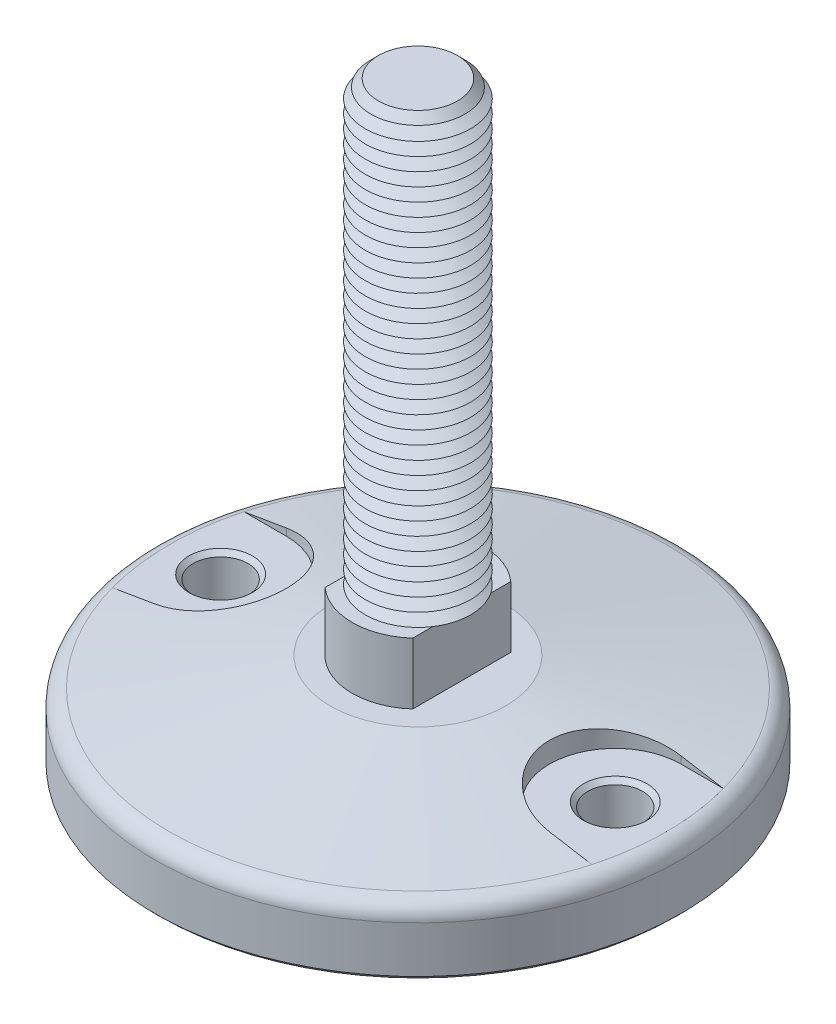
from build123d import *

# Parameters (mm, degrees)
FILLET1_R                = 4
SKETCH3_R                = 15
BOSS_EXTRUDE1_DEPTH      = 14
CUT_EXTRUDE1_START       = -14
CUT_EXTRUDE1_DEPTH       = 14
SKETCH5_R                = 12
BOSS_EXTRUDE2_DEPTH      = 100
CHAMFER1_SIZE            = 3
LPATTERN1_COUNT          = 33
LPATTERN1_PITCH          = 3
CUT_EXTRUDE4_DEPTH       = 6.47
SKETCH10_R               = 6.25
CUT_EXTRUDE5_DEPTH       = 15.53
CHAMFER2_SIZE            = 1
CHAMFER2_OF_MIRROR1_SIZE = 1
CHAMFER3_SIZE            = 1


with BuildPart() as part:
    # Sketch2 → Revolve1 (revolve)
    with BuildSketch(Plane(origin=(0, 0, 0), x_dir=(0, 0, -1), z_dir=(1, 0, 0)), mode=Mode.PRIVATE) as revolve1_sk:
        Polygon((0, 0), (-20, 0), (-60, -7.053079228), (-60, -22), (0, -22), align=None)
    revolve(revolve1_sk.sketch.rotate(Axis((0, 61.338865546, 0), (0, -1, 0)), 180), axis=Axis((0, 61.338865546, 0), (0, -1, 0)))

    # Fillet1
    fillet1_edges = [part.edges().sort_by_distance(p)[0] for p in [
        (0, -7.053079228, 60),
    ]]
    fillet(fillet1_edges, radius=FILLET1_R)

    # Sketch3 → Boss-Extrude1 (add)
    with BuildSketch(Plane(origin=(0, 0, 0), x_dir=(1, 0, 0), z_dir=(0, 1, 0))):
        with Locations(Location((0, 0, 0), (0, 0, 270))):
            Circle(SKETCH3_R)
    extrude(amount=BOSS_EXTRUDE1_DEPTH)

    # Sketch4 → Cut-Extrude1 (cut)
    with BuildSketch(Plane(origin=(0, 14, 0), x_dir=(1, 0, 0), z_dir=(0, 1, 0)).offset(CUT_EXTRUDE1_START)):
        with BuildLine():
            Line((-10, 11.180339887), (-10, -11.180339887))
            ThreePointArc((-10, -11.180339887), (-15, 0), (-10, 11.180339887))
        make_face()
        with BuildLine():
            Line((10, -11.180339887), (10, 11.180339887))
            ThreePointArc((10, 11.180339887), (15, 0), (10, -11.180339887))
        make_face()
    extrude(amount=CUT_EXTRUDE1_DEPTH, mode=Mode.SUBTRACT)

    # Sketch5 → Boss-Extrude2 (add)
    with BuildSketch(Plane(origin=(0, 14, 0), x_dir=(1, 0, 0), z_dir=(0, 1, 0))):
        with Locations(Location((0, 0, 0), (0, 0, 33.557309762))):
            Circle(SKETCH5_R)
    extrude(amount=BOSS_EXTRUDE2_DEPTH)

    # Chamfer1
    chamfer1_edges = [part.edges().sort_by_distance(p)[0] for p in [
        (-10, 114, 6.633249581),
    ]]
    chamfer(chamfer1_edges, length=CHAMFER1_SIZE)

    # Sketch6 → Cut-Revolve1 (revolve, cut)
    with BuildSketch(Plane(origin=(0, 0, 0), x_dir=(0, 0, -1), z_dir=(1, 0, 0))):
        Polygon((-12, 14), (-9.401923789, 15.5), (-12, 17), align=None)
    cut_revolve1 = revolve(axis=Axis((0, 61.338865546, 0), (0, -1, 0)), mode=Mode.SUBTRACT)

    # LPattern1: Cut-Revolve1 ×33
    with Locations(*[(0, i * LPATTERN1_PITCH, 0) for i in range(1, LPATTERN1_COUNT)]):
        add(cut_revolve1, mode=Mode.SUBTRACT)

    # Sketch8 → Cut-Extrude4 (cut)
    with BuildSketch(Plane(origin=(0, 0, 0), x_dir=(1, 0, 0), z_dir=(0, 1, 0))):
        with BuildLine():
            Line((-45, 15), (-54.674279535, 15))
            ThreePointArc((-54.674279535, 15), (-56.694592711, 0), (-54.674279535, -15))
            Line((-54.674279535, -15), (-45, -15))
            ThreePointArc((-45, -15), (-30, 0), (-45, 15))
        make_face()
    cut_extrude4 = extrude(amount=-CUT_EXTRUDE4_DEPTH, mode=Mode.SUBTRACT)

    # Sketch10 → Cut-Extrude5 (cut)
    with BuildSketch(Plane(origin=(0, -6.47, 0), x_dir=(1, 0, 0), z_dir=(0, 1, 0))):
        with Locations(Location((-45, 0, 0), (0, 0, 270))):
            Circle(SKETCH10_R)
    cut_extrude5 = extrude(amount=-CUT_EXTRUDE5_DEPTH, mode=Mode.SUBTRACT)

    # Chamfer2
    chamfer2_edges = [part.edges().sort_by_distance(p)[0] for p in [
        (-45, -6.47, -6.25),
        (-45, -22, -6.25),
    ]]
    chamfer(chamfer2_edges, length=CHAMFER2_SIZE)

    # Mirror1: Cut-Extrude4, Cut-Extrude5 across plane
    add(cut_extrude4.mirror(Plane(origin=(0, 0, 0), x_dir=(0, 0, 1), z_dir=(1, 0, 0))), mode=Mode.SUBTRACT)
    add(cut_extrude5.mirror(Plane(origin=(0, 0, 0), x_dir=(0, 0, 1), z_dir=(1, 0, 0))), mode=Mode.SUBTRACT)

    # Chamfer2 of Mirror1
    chamfer2_of_mirror1_edges = [part.edges().sort_by_distance(p)[0] for p in [
        (45, -6.47, -6.25),
        (45, -22, -6.25),
    ]]
    chamfer(chamfer2_of_mirror1_edges, length=CHAMFER2_OF_MIRROR1_SIZE)

    # Chamfer3
    chamfer3_edges = [part.edges().sort_by_distance(p)[0] for p in [
        (0, -22, 60),
    ]]
    chamfer(chamfer3_edges, length=CHAMFER3_SIZE)


solid = part.part
